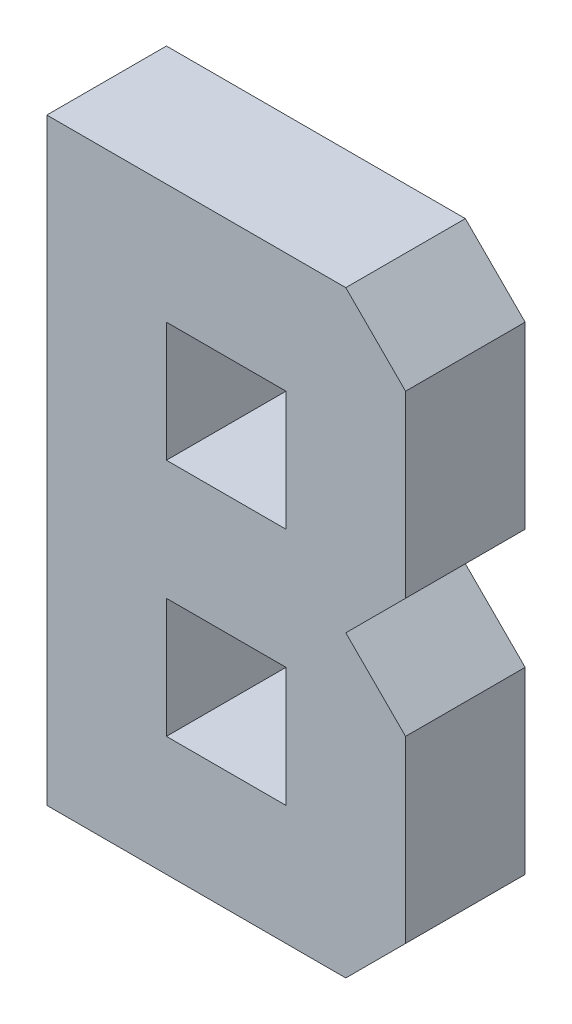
ISO-10303-21;
HEADER;
FILE_DESCRIPTION(('STEP AP214'),'2;1');
FILE_NAME('part.step','',(''),(''),'','','');
FILE_SCHEMA(('AUTOMOTIVE_DESIGN { 1 0 10303 214 1 1 1 1 }'));
ENDSEC;
DATA;
#1=APPLICATION_CONTEXT('core data for automotive mechanical design processes');
#2=APPLICATION_PROTOCOL_DEFINITION('international standard','automotive_design',2000,#1);
#3=PRODUCT_CONTEXT('',#1,'mechanical');
#4=PRODUCT('Part','Part','',(#3));
#5=PRODUCT_RELATED_PRODUCT_CATEGORY('part','',(#4));
#6=PRODUCT_DEFINITION_FORMATION('','',#4);
#7=PRODUCT_DEFINITION_CONTEXT('part definition',#1,'design');
#8=PRODUCT_DEFINITION('design','',#6,#7);
#9=PRODUCT_DEFINITION_SHAPE('','',#8);
#10=(LENGTH_UNIT() NAMED_UNIT(*) SI_UNIT(.MILLI.,.METRE.));
#11=(NAMED_UNIT(*) PLANE_ANGLE_UNIT() SI_UNIT($,.RADIAN.));
#12=(NAMED_UNIT(*) SI_UNIT($,.STERADIAN.) SOLID_ANGLE_UNIT());
#13=UNCERTAINTY_MEASURE_WITH_UNIT(LENGTH_MEASURE(1.E-05),#10,'distance_accuracy_value','');
#14=(GEOMETRIC_REPRESENTATION_CONTEXT(3) GLOBAL_UNCERTAINTY_ASSIGNED_CONTEXT((#13)) GLOBAL_UNIT_ASSIGNED_CONTEXT((#10,
#11,#12)) REPRESENTATION_CONTEXT('',''));
#15=CARTESIAN_POINT('',(0.,0.,0.));
#16=DIRECTION('',(0.,0.,1.));
#17=DIRECTION('',(1.,0.,0.));
#18=AXIS2_PLACEMENT_3D('',#15,#16,#17);
#19=CARTESIAN_POINT('',(0.,0.,10.));
#20=DIRECTION('',(0.,0.,-1.));
#21=DIRECTION('',(-1.,0.,0.));
#22=AXIS2_PLACEMENT_3D('',#19,#20,#21);
#23=PLANE('',#22);
#24=DIRECTION('',(0.,-1.,0.));
#25=VECTOR('',#24,1.);
#26=CARTESIAN_POINT('',(9.99999999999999,40.,10.));
#27=LINE('',#26,#25);
#28=CARTESIAN_POINT('',(9.99999999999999,40.,10.));
#29=VERTEX_POINT('',#28);
#30=CARTESIAN_POINT('',(10.,30.,10.));
#31=VERTEX_POINT('',#30);
#32=EDGE_CURVE('E193',#29,#31,#27,.T.);
#33=ORIENTED_EDGE('',*,*,#32,.F.);
#34=DIRECTION('',(-1.,0.,0.));
#35=VECTOR('',#34,1.);
#36=CARTESIAN_POINT('',(9.99999999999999,40.,10.));
#37=LINE('',#36,#35);
#38=CARTESIAN_POINT('',(20.,40.,10.));
#39=VERTEX_POINT('',#38);
#40=EDGE_CURVE('E201',#39,#29,#37,.T.);
#41=ORIENTED_EDGE('',*,*,#40,.F.);
#42=DIRECTION('',(0.,1.,0.));
#43=VECTOR('',#42,1.);
#44=CARTESIAN_POINT('',(20.,40.,10.));
#45=LINE('',#44,#43);
#46=CARTESIAN_POINT('',(20.,30.,10.));
#47=VERTEX_POINT('',#46);
#48=EDGE_CURVE('E198',#47,#39,#45,.T.);
#49=ORIENTED_EDGE('',*,*,#48,.F.);
#50=DIRECTION('',(1.,0.,0.));
#51=VECTOR('',#50,1.);
#52=CARTESIAN_POINT('',(10.,30.,10.));
#53=LINE('',#52,#51);
#54=EDGE_CURVE('E195',#31,#47,#53,.T.);
#55=ORIENTED_EDGE('',*,*,#54,.F.);
#56=EDGE_LOOP('',(#33,#41,#49,#55));
#57=FACE_BOUND('',#56,.T.);
#58=DIRECTION('',(0.,1.,0.));
#59=VECTOR('',#58,1.);
#60=CARTESIAN_POINT('',(30.,30.,10.));
#61=LINE('',#60,#59);
#62=CARTESIAN_POINT('',(30.,30.,10.));
#63=VERTEX_POINT('',#62);
#64=CARTESIAN_POINT('',(30.,45.,10.));
#65=VERTEX_POINT('',#64);
#66=EDGE_CURVE('E233',#63,#65,#61,.T.);
#67=ORIENTED_EDGE('',*,*,#66,.T.);
#68=DIRECTION('',(0.707106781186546,-0.707106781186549,0.));
#69=VECTOR('',#68,1.);
#70=CARTESIAN_POINT('',(25.,50.,10.));
#71=LINE('',#70,#69);
#72=CARTESIAN_POINT('',(25.,50.,10.));
#73=VERTEX_POINT('',#72);
#74=EDGE_CURVE('E273',#65,#73,#71,.F.);
#75=ORIENTED_EDGE('',*,*,#74,.T.);
#76=DIRECTION('',(-1.,0.,0.));
#77=VECTOR('',#76,1.);
#78=CARTESIAN_POINT('',(0.,50.,10.));
#79=LINE('',#78,#77);
#80=CARTESIAN_POINT('',(0.,50.,10.));
#81=VERTEX_POINT('',#80);
#82=EDGE_CURVE('E236',#73,#81,#79,.T.);
#83=ORIENTED_EDGE('',*,*,#82,.T.);
#84=DIRECTION('',(0.,-1.,0.));
#85=VECTOR('',#84,1.);
#86=CARTESIAN_POINT('',(0.,0.,10.));
#87=LINE('',#86,#85);
#88=CARTESIAN_POINT('',(0.,0.,10.));
#89=VERTEX_POINT('',#88);
#90=EDGE_CURVE('E224',#81,#89,#87,.T.);
#91=ORIENTED_EDGE('',*,*,#90,.T.);
#92=DIRECTION('',(1.,0.,0.));
#93=VECTOR('',#92,1.);
#94=CARTESIAN_POINT('',(0.,0.,10.));
#95=LINE('',#94,#93);
#96=CARTESIAN_POINT('',(25.,0.,10.));
#97=VERTEX_POINT('',#96);
#98=EDGE_CURVE('E227',#89,#97,#95,.T.);
#99=ORIENTED_EDGE('',*,*,#98,.T.);
#100=DIRECTION('',(-0.707106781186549,-0.707106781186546,0.));
#101=VECTOR('',#100,1.);
#102=CARTESIAN_POINT('',(30.,5.,10.));
#103=LINE('',#102,#101);
#104=CARTESIAN_POINT('',(30.,5.,10.));
#105=VERTEX_POINT('',#104);
#106=EDGE_CURVE('E271',#97,#105,#103,.F.);
#107=ORIENTED_EDGE('',*,*,#106,.T.);
#108=DIRECTION('',(0.,1.,0.));
#109=VECTOR('',#108,1.);
#110=CARTESIAN_POINT('',(30.,0.,10.));
#111=LINE('',#110,#109);
#112=CARTESIAN_POINT('',(30.,20.,10.));
#113=VERTEX_POINT('',#112);
#114=EDGE_CURVE('E231',#105,#113,#111,.T.);
#115=ORIENTED_EDGE('',*,*,#114,.T.);
#116=DIRECTION('',(0.707106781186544,-0.707106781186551,0.));
#117=VECTOR('',#116,1.);
#118=CARTESIAN_POINT('',(25.0000000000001,24.9999999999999,10.));
#119=LINE('',#118,#117);
#120=CARTESIAN_POINT('',(25.,25.,10.));
#121=VERTEX_POINT('',#120);
#122=EDGE_CURVE('E11',#113,#121,#119,.F.);
#123=ORIENTED_EDGE('',*,*,#122,.T.);
#124=DIRECTION('',(-0.707106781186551,-0.707106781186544,0.));
#125=VECTOR('',#124,1.);
#126=CARTESIAN_POINT('',(-1.27570012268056E-13,1.27570012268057E-13,10.));
#127=LINE('',#126,#125);
#128=EDGE_CURVE('E281',#121,#63,#127,.F.);
#129=ORIENTED_EDGE('',*,*,#128,.T.);
#130=EDGE_LOOP('',(#67,#75,#83,#91,#99,#107,#115,#123,#129));
#131=FACE_BOUND('',#130,.T.);
#132=DIRECTION('',(0.,-1.,0.));
#133=VECTOR('',#132,1.);
#134=CARTESIAN_POINT('',(10.,20.,10.));
#135=LINE('',#134,#133);
#136=CARTESIAN_POINT('',(10.,20.,10.));
#137=VERTEX_POINT('',#136);
#138=CARTESIAN_POINT('',(10.,10.,10.));
#139=VERTEX_POINT('',#138);
#140=EDGE_CURVE('E152',#137,#139,#135,.T.);
#141=ORIENTED_EDGE('',*,*,#140,.F.);
#142=DIRECTION('',(-1.,0.,0.));
#143=VECTOR('',#142,1.);
#144=CARTESIAN_POINT('',(10.,20.,10.));
#145=LINE('',#144,#143);
#146=CARTESIAN_POINT('',(20.,20.,10.));
#147=VERTEX_POINT('',#146);
#148=EDGE_CURVE('E177',#147,#137,#145,.T.);
#149=ORIENTED_EDGE('',*,*,#148,.F.);
#150=DIRECTION('',(0.,1.,0.));
#151=VECTOR('',#150,1.);
#152=CARTESIAN_POINT('',(20.,20.,10.));
#153=LINE('',#152,#151);
#154=CARTESIAN_POINT('',(20.,10.,10.));
#155=VERTEX_POINT('',#154);
#156=EDGE_CURVE('E175',#155,#147,#153,.T.);
#157=ORIENTED_EDGE('',*,*,#156,.F.);
#158=DIRECTION('',(1.,0.,0.));
#159=VECTOR('',#158,1.);
#160=CARTESIAN_POINT('',(10.,10.,10.));
#161=LINE('',#160,#159);
#162=EDGE_CURVE('E162',#139,#155,#161,.T.);
#163=ORIENTED_EDGE('',*,*,#162,.F.);
#164=EDGE_LOOP('',(#141,#149,#157,#163));
#165=FACE_BOUND('',#164,.T.);
#166=ADVANCED_FACE('F33',(#57,#131,#165),#23,.F.);
#167=CARTESIAN_POINT('',(0.,0.,0.));
#168=DIRECTION('',(0.,0.,-1.));
#169=DIRECTION('',(-1.,0.,0.));
#170=AXIS2_PLACEMENT_3D('',#167,#168,#169);
#171=PLANE('',#170);
#172=DIRECTION('',(-1.,0.,0.));
#173=VECTOR('',#172,1.);
#174=CARTESIAN_POINT('',(0.,50.,0.));
#175=LINE('',#174,#173);
#176=CARTESIAN_POINT('',(25.,50.,0.));
#177=VERTEX_POINT('',#176);
#178=CARTESIAN_POINT('',(0.,50.,0.));
#179=VERTEX_POINT('',#178);
#180=EDGE_CURVE('E228',#177,#179,#175,.T.);
#181=ORIENTED_EDGE('',*,*,#180,.F.);
#182=DIRECTION('',(-0.707106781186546,0.707106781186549,0.));
#183=VECTOR('',#182,1.);
#184=CARTESIAN_POINT('',(37.5,37.4999999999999,0.));
#185=LINE('',#184,#183);
#186=CARTESIAN_POINT('',(30.,45.,0.));
#187=VERTEX_POINT('',#186);
#188=EDGE_CURVE('E267',#177,#187,#185,.F.);
#189=ORIENTED_EDGE('',*,*,#188,.T.);
#190=DIRECTION('',(0.,1.,0.));
#191=VECTOR('',#190,1.);
#192=CARTESIAN_POINT('',(30.,30.,0.));
#193=LINE('',#192,#191);
#194=CARTESIAN_POINT('',(30.,30.,0.));
#195=VERTEX_POINT('',#194);
#196=EDGE_CURVE('E247',#195,#187,#193,.T.);
#197=ORIENTED_EDGE('',*,*,#196,.F.);
#198=DIRECTION('',(0.707106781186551,0.707106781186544,0.));
#199=VECTOR('',#198,1.);
#200=CARTESIAN_POINT('',(30.,30.,0.));
#201=LINE('',#200,#199);
#202=CARTESIAN_POINT('',(25.,25.,0.));
#203=VERTEX_POINT('',#202);
#204=EDGE_CURVE('E55',#195,#203,#201,.F.);
#205=ORIENTED_EDGE('',*,*,#204,.T.);
#206=DIRECTION('',(-0.707106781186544,0.707106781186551,0.));
#207=VECTOR('',#206,1.);
#208=CARTESIAN_POINT('',(25.,25.,0.));
#209=LINE('',#208,#207);
#210=CARTESIAN_POINT('',(30.,20.,0.));
#211=VERTEX_POINT('',#210);
#212=EDGE_CURVE('E42',#203,#211,#209,.F.);
#213=ORIENTED_EDGE('',*,*,#212,.T.);
#214=DIRECTION('',(0.,1.,0.));
#215=VECTOR('',#214,1.);
#216=CARTESIAN_POINT('',(30.,0.,0.));
#217=LINE('',#216,#215);
#218=CARTESIAN_POINT('',(30.,5.,0.));
#219=VERTEX_POINT('',#218);
#220=EDGE_CURVE('E244',#219,#211,#217,.T.);
#221=ORIENTED_EDGE('',*,*,#220,.F.);
#222=DIRECTION('',(0.707106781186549,0.707106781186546,0.));
#223=VECTOR('',#222,1.);
#224=CARTESIAN_POINT('',(12.4999999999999,-12.5,0.));
#225=LINE('',#224,#223);
#226=CARTESIAN_POINT('',(25.,0.,0.));
#227=VERTEX_POINT('',#226);
#228=EDGE_CURVE('E265',#219,#227,#225,.F.);
#229=ORIENTED_EDGE('',*,*,#228,.T.);
#230=DIRECTION('',(1.,0.,0.));
#231=VECTOR('',#230,1.);
#232=CARTESIAN_POINT('',(0.,0.,0.));
#233=LINE('',#232,#231);
#234=CARTESIAN_POINT('',(0.,0.,0.));
#235=VERTEX_POINT('',#234);
#236=EDGE_CURVE('E241',#235,#227,#233,.T.);
#237=ORIENTED_EDGE('',*,*,#236,.F.);
#238=DIRECTION('',(0.,-1.,0.));
#239=VECTOR('',#238,1.);
#240=CARTESIAN_POINT('',(0.,0.,0.));
#241=LINE('',#240,#239);
#242=EDGE_CURVE('E223',#179,#235,#241,.T.);
#243=ORIENTED_EDGE('',*,*,#242,.F.);
#244=EDGE_LOOP('',(#181,#189,#197,#205,#213,#221,#229,#237,#243));
#245=FACE_BOUND('',#244,.T.);
#246=DIRECTION('',(-1.,0.,0.));
#247=VECTOR('',#246,1.);
#248=CARTESIAN_POINT('',(9.99999999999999,40.,0.));
#249=LINE('',#248,#247);
#250=CARTESIAN_POINT('',(20.,40.,0.));
#251=VERTEX_POINT('',#250);
#252=CARTESIAN_POINT('',(9.99999999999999,40.,0.));
#253=VERTEX_POINT('',#252);
#254=EDGE_CURVE('E196',#251,#253,#249,.T.);
#255=ORIENTED_EDGE('',*,*,#254,.T.);
#256=DIRECTION('',(0.,-1.,0.));
#257=VECTOR('',#256,1.);
#258=CARTESIAN_POINT('',(9.99999999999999,40.,0.));
#259=LINE('',#258,#257);
#260=CARTESIAN_POINT('',(10.,30.,0.));
#261=VERTEX_POINT('',#260);
#262=EDGE_CURVE('E170',#253,#261,#259,.T.);
#263=ORIENTED_EDGE('',*,*,#262,.T.);
#264=DIRECTION('',(1.,0.,0.));
#265=VECTOR('',#264,1.);
#266=CARTESIAN_POINT('',(10.,30.,0.));
#267=LINE('',#266,#265);
#268=CARTESIAN_POINT('',(20.,30.,0.));
#269=VERTEX_POINT('',#268);
#270=EDGE_CURVE('E206',#261,#269,#267,.T.);
#271=ORIENTED_EDGE('',*,*,#270,.T.);
#272=DIRECTION('',(0.,1.,0.));
#273=VECTOR('',#272,1.);
#274=CARTESIAN_POINT('',(20.,40.,0.));
#275=LINE('',#274,#273);
#276=EDGE_CURVE('E209',#269,#251,#275,.T.);
#277=ORIENTED_EDGE('',*,*,#276,.T.);
#278=EDGE_LOOP('',(#255,#263,#271,#277));
#279=FACE_BOUND('',#278,.T.);
#280=DIRECTION('',(-1.,0.,0.));
#281=VECTOR('',#280,1.);
#282=CARTESIAN_POINT('',(10.,20.,0.));
#283=LINE('',#282,#281);
#284=CARTESIAN_POINT('',(20.,20.,0.));
#285=VERTEX_POINT('',#284);
#286=CARTESIAN_POINT('',(10.,20.,0.));
#287=VERTEX_POINT('',#286);
#288=EDGE_CURVE('E163',#285,#287,#283,.T.);
#289=ORIENTED_EDGE('',*,*,#288,.T.);
#290=DIRECTION('',(0.,-1.,0.));
#291=VECTOR('',#290,1.);
#292=CARTESIAN_POINT('',(10.,20.,0.));
#293=LINE('',#292,#291);
#294=CARTESIAN_POINT('',(10.,10.,0.));
#295=VERTEX_POINT('',#294);
#296=EDGE_CURVE('E181',#287,#295,#293,.T.);
#297=ORIENTED_EDGE('',*,*,#296,.T.);
#298=DIRECTION('',(1.,0.,0.));
#299=VECTOR('',#298,1.);
#300=CARTESIAN_POINT('',(10.,10.,0.));
#301=LINE('',#300,#299);
#302=CARTESIAN_POINT('',(20.,10.,0.));
#303=VERTEX_POINT('',#302);
#304=EDGE_CURVE('E169',#295,#303,#301,.T.);
#305=ORIENTED_EDGE('',*,*,#304,.T.);
#306=DIRECTION('',(0.,1.,0.));
#307=VECTOR('',#306,1.);
#308=CARTESIAN_POINT('',(20.,20.,0.));
#309=LINE('',#308,#307);
#310=EDGE_CURVE('E184',#303,#285,#309,.T.);
#311=ORIENTED_EDGE('',*,*,#310,.T.);
#312=EDGE_LOOP('',(#289,#297,#305,#311));
#313=FACE_BOUND('',#312,.T.);
#314=ADVANCED_FACE('F285',(#245,#279,#313),#171,.T.);
#315=CARTESIAN_POINT('',(0.,0.,10.));
#316=DIRECTION('',(1.,0.,0.));
#317=DIRECTION('',(0.,0.,-1.));
#318=AXIS2_PLACEMENT_3D('',#315,#316,#317);
#319=PLANE('',#318);
#320=ORIENTED_EDGE('',*,*,#242,.T.);
#321=DIRECTION('',(0.,0.,-1.));
#322=VECTOR('',#321,1.);
#323=CARTESIAN_POINT('',(0.,0.,10.));
#324=LINE('',#323,#322);
#325=EDGE_CURVE('E259',#89,#235,#324,.T.);
#326=ORIENTED_EDGE('',*,*,#325,.F.);
#327=ORIENTED_EDGE('',*,*,#90,.F.);
#328=DIRECTION('',(0.,0.,-1.));
#329=VECTOR('',#328,1.);
#330=CARTESIAN_POINT('',(0.,50.,10.));
#331=LINE('',#330,#329);
#332=EDGE_CURVE('E238',#81,#179,#331,.T.);
#333=ORIENTED_EDGE('',*,*,#332,.T.);
#334=EDGE_LOOP('',(#320,#326,#327,#333));
#335=FACE_BOUND('',#334,.T.);
#336=ADVANCED_FACE('F314',(#335),#319,.F.);
#337=CARTESIAN_POINT('',(0.,0.,10.));
#338=DIRECTION('',(0.,1.,0.));
#339=DIRECTION('',(0.,0.,1.));
#340=AXIS2_PLACEMENT_3D('',#337,#338,#339);
#341=PLANE('',#340);
#342=ORIENTED_EDGE('',*,*,#236,.T.);
#343=DIRECTION('',(0.,0.,1.));
#344=VECTOR('',#343,1.);
#345=CARTESIAN_POINT('',(25.,0.,10.));
#346=LINE('',#345,#344);
#347=EDGE_CURVE('E278',#227,#97,#346,.T.);
#348=ORIENTED_EDGE('',*,*,#347,.T.);
#349=ORIENTED_EDGE('',*,*,#98,.F.);
#350=ORIENTED_EDGE('',*,*,#325,.T.);
#351=EDGE_LOOP('',(#342,#348,#349,#350));
#352=FACE_BOUND('',#351,.T.);
#353=ADVANCED_FACE('F320',(#352),#341,.F.);
#354=CARTESIAN_POINT('',(30.,0.,10.));
#355=DIRECTION('',(-1.,0.,0.));
#356=DIRECTION('',(0.,0.,1.));
#357=AXIS2_PLACEMENT_3D('',#354,#355,#356);
#358=PLANE('',#357);
#359=ORIENTED_EDGE('',*,*,#114,.F.);
#360=DIRECTION('',(0.,0.,-1.));
#361=VECTOR('',#360,1.);
#362=CARTESIAN_POINT('',(30.,5.,10.));
#363=LINE('',#362,#361);
#364=EDGE_CURVE('E275',#105,#219,#363,.T.);
#365=ORIENTED_EDGE('',*,*,#364,.T.);
#366=ORIENTED_EDGE('',*,*,#220,.T.);
#367=DIRECTION('',(0.,0.,-1.));
#368=VECTOR('',#367,1.);
#369=CARTESIAN_POINT('',(30.,20.,10.));
#370=LINE('',#369,#368);
#371=EDGE_CURVE('E256',#113,#211,#370,.T.);
#372=ORIENTED_EDGE('',*,*,#371,.F.);
#373=EDGE_LOOP('',(#359,#365,#366,#372));
#374=FACE_BOUND('',#373,.T.);
#375=ADVANCED_FACE('F292',(#374),#358,.F.);
#376=CARTESIAN_POINT('',(30.,30.,10.));
#377=DIRECTION('',(-1.,0.,0.));
#378=DIRECTION('',(0.,0.,1.));
#379=AXIS2_PLACEMENT_3D('',#376,#377,#378);
#380=PLANE('',#379);
#381=ORIENTED_EDGE('',*,*,#196,.T.);
#382=DIRECTION('',(0.,0.,1.));
#383=VECTOR('',#382,1.);
#384=CARTESIAN_POINT('',(30.,45.,10.));
#385=LINE('',#384,#383);
#386=EDGE_CURVE('E269',#187,#65,#385,.T.);
#387=ORIENTED_EDGE('',*,*,#386,.T.);
#388=ORIENTED_EDGE('',*,*,#66,.F.);
#389=DIRECTION('',(0.,0.,-1.));
#390=VECTOR('',#389,1.);
#391=CARTESIAN_POINT('',(30.,30.,10.));
#392=LINE('',#391,#390);
#393=EDGE_CURVE('E253',#63,#195,#392,.T.);
#394=ORIENTED_EDGE('',*,*,#393,.T.);
#395=EDGE_LOOP('',(#381,#387,#388,#394));
#396=FACE_BOUND('',#395,.T.);
#397=ADVANCED_FACE('F301',(#396),#380,.F.);
#398=CARTESIAN_POINT('',(0.,50.,10.));
#399=DIRECTION('',(0.,-1.,0.));
#400=DIRECTION('',(0.,0.,-1.));
#401=AXIS2_PLACEMENT_3D('',#398,#399,#400);
#402=PLANE('',#401);
#403=ORIENTED_EDGE('',*,*,#82,.F.);
#404=DIRECTION('',(0.,0.,-1.));
#405=VECTOR('',#404,1.);
#406=CARTESIAN_POINT('',(25.,50.,10.));
#407=LINE('',#406,#405);
#408=EDGE_CURVE('E262',#73,#177,#407,.T.);
#409=ORIENTED_EDGE('',*,*,#408,.T.);
#410=ORIENTED_EDGE('',*,*,#180,.T.);
#411=ORIENTED_EDGE('',*,*,#332,.F.);
#412=EDGE_LOOP('',(#403,#409,#410,#411));
#413=FACE_BOUND('',#412,.T.);
#414=ADVANCED_FACE('F309',(#413),#402,.F.);
#415=CARTESIAN_POINT('',(9.99999999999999,40.,10.));
#416=DIRECTION('',(1.,0.,0.));
#417=DIRECTION('',(0.,1.,0.));
#418=AXIS2_PLACEMENT_3D('',#415,#416,#417);
#419=PLANE('',#418);
#420=ORIENTED_EDGE('',*,*,#262,.F.);
#421=DIRECTION('',(0.,0.,-1.));
#422=VECTOR('',#421,1.);
#423=CARTESIAN_POINT('',(9.99999999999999,40.,10.));
#424=LINE('',#423,#422);
#425=EDGE_CURVE('E203',#29,#253,#424,.T.);
#426=ORIENTED_EDGE('',*,*,#425,.F.);
#427=ORIENTED_EDGE('',*,*,#32,.T.);
#428=DIRECTION('',(0.,0.,-1.));
#429=VECTOR('',#428,1.);
#430=CARTESIAN_POINT('',(10.,30.,10.));
#431=LINE('',#430,#429);
#432=EDGE_CURVE('E220',#31,#261,#431,.T.);
#433=ORIENTED_EDGE('',*,*,#432,.T.);
#434=EDGE_LOOP('',(#420,#426,#427,#433));
#435=FACE_BOUND('',#434,.T.);
#436=ADVANCED_FACE('F338',(#435),#419,.T.);
#437=CARTESIAN_POINT('',(10.,30.,10.));
#438=DIRECTION('',(0.,1.,0.));
#439=DIRECTION('',(0.,0.,1.));
#440=AXIS2_PLACEMENT_3D('',#437,#438,#439);
#441=PLANE('',#440);
#442=ORIENTED_EDGE('',*,*,#270,.F.);
#443=ORIENTED_EDGE('',*,*,#432,.F.);
#444=ORIENTED_EDGE('',*,*,#54,.T.);
#445=DIRECTION('',(0.,0.,-1.));
#446=VECTOR('',#445,1.);
#447=CARTESIAN_POINT('',(20.,30.,10.));
#448=LINE('',#447,#446);
#449=EDGE_CURVE('E218',#47,#269,#448,.T.);
#450=ORIENTED_EDGE('',*,*,#449,.T.);
#451=EDGE_LOOP('',(#442,#443,#444,#450));
#452=FACE_BOUND('',#451,.T.);
#453=ADVANCED_FACE('F359',(#452),#441,.T.);
#454=CARTESIAN_POINT('',(20.,40.,10.));
#455=DIRECTION('',(-1.,0.,0.));
#456=DIRECTION('',(0.,-1.,0.));
#457=AXIS2_PLACEMENT_3D('',#454,#455,#456);
#458=PLANE('',#457);
#459=ORIENTED_EDGE('',*,*,#276,.F.);
#460=ORIENTED_EDGE('',*,*,#449,.F.);
#461=ORIENTED_EDGE('',*,*,#48,.T.);
#462=DIRECTION('',(0.,0.,-1.));
#463=VECTOR('',#462,1.);
#464=CARTESIAN_POINT('',(20.,40.,10.));
#465=LINE('',#464,#463);
#466=EDGE_CURVE('E216',#39,#251,#465,.T.);
#467=ORIENTED_EDGE('',*,*,#466,.T.);
#468=EDGE_LOOP('',(#459,#460,#461,#467));
#469=FACE_BOUND('',#468,.T.);
#470=ADVANCED_FACE('F367',(#469),#458,.T.);
#471=CARTESIAN_POINT('',(9.99999999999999,40.,10.));
#472=DIRECTION('',(0.,-1.,0.));
#473=DIRECTION('',(0.,0.,-1.));
#474=AXIS2_PLACEMENT_3D('',#471,#472,#473);
#475=PLANE('',#474);
#476=ORIENTED_EDGE('',*,*,#254,.F.);
#477=ORIENTED_EDGE('',*,*,#466,.F.);
#478=ORIENTED_EDGE('',*,*,#40,.T.);
#479=ORIENTED_EDGE('',*,*,#425,.T.);
#480=EDGE_LOOP('',(#476,#477,#478,#479));
#481=FACE_BOUND('',#480,.T.);
#482=ADVANCED_FACE('F374',(#481),#475,.T.);
#483=CARTESIAN_POINT('',(10.,20.,10.));
#484=DIRECTION('',(1.,0.,0.));
#485=DIRECTION('',(0.,0.,-1.));
#486=AXIS2_PLACEMENT_3D('',#483,#484,#485);
#487=PLANE('',#486);
#488=ORIENTED_EDGE('',*,*,#296,.F.);
#489=DIRECTION('',(0.,0.,-1.));
#490=VECTOR('',#489,1.);
#491=CARTESIAN_POINT('',(10.,20.,10.));
#492=LINE('',#491,#490);
#493=EDGE_CURVE('E158',#137,#287,#492,.T.);
#494=ORIENTED_EDGE('',*,*,#493,.F.);
#495=ORIENTED_EDGE('',*,*,#140,.T.);
#496=DIRECTION('',(0.,0.,-1.));
#497=VECTOR('',#496,1.);
#498=CARTESIAN_POINT('',(10.,10.,10.));
#499=LINE('',#498,#497);
#500=EDGE_CURVE('E155',#139,#295,#499,.T.);
#501=ORIENTED_EDGE('',*,*,#500,.T.);
#502=EDGE_LOOP('',(#488,#494,#495,#501));
#503=FACE_BOUND('',#502,.T.);
#504=ADVANCED_FACE('F154',(#503),#487,.T.);
#505=CARTESIAN_POINT('',(10.,10.,10.));
#506=DIRECTION('',(0.,1.,0.));
#507=DIRECTION('',(0.,0.,1.));
#508=AXIS2_PLACEMENT_3D('',#505,#506,#507);
#509=PLANE('',#508);
#510=ORIENTED_EDGE('',*,*,#304,.F.);
#511=ORIENTED_EDGE('',*,*,#500,.F.);
#512=ORIENTED_EDGE('',*,*,#162,.T.);
#513=DIRECTION('',(0.,0.,-1.));
#514=VECTOR('',#513,1.);
#515=CARTESIAN_POINT('',(20.,10.,10.));
#516=LINE('',#515,#514);
#517=EDGE_CURVE('E171',#155,#303,#516,.T.);
#518=ORIENTED_EDGE('',*,*,#517,.T.);
#519=EDGE_LOOP('',(#510,#511,#512,#518));
#520=FACE_BOUND('',#519,.T.);
#521=ADVANCED_FACE('F166',(#520),#509,.T.);
#522=CARTESIAN_POINT('',(20.,20.,10.));
#523=DIRECTION('',(-1.,0.,0.));
#524=DIRECTION('',(0.,-1.,0.));
#525=AXIS2_PLACEMENT_3D('',#522,#523,#524);
#526=PLANE('',#525);
#527=ORIENTED_EDGE('',*,*,#310,.F.);
#528=ORIENTED_EDGE('',*,*,#517,.F.);
#529=ORIENTED_EDGE('',*,*,#156,.T.);
#530=DIRECTION('',(0.,0.,-1.));
#531=VECTOR('',#530,1.);
#532=CARTESIAN_POINT('',(20.,20.,10.));
#533=LINE('',#532,#531);
#534=EDGE_CURVE('E190',#147,#285,#533,.T.);
#535=ORIENTED_EDGE('',*,*,#534,.T.);
#536=EDGE_LOOP('',(#527,#528,#529,#535));
#537=FACE_BOUND('',#536,.T.);
#538=ADVANCED_FACE('F395',(#537),#526,.T.);
#539=CARTESIAN_POINT('',(10.,20.,10.));
#540=DIRECTION('',(0.,-1.,0.));
#541=DIRECTION('',(0.,0.,-1.));
#542=AXIS2_PLACEMENT_3D('',#539,#540,#541);
#543=PLANE('',#542);
#544=ORIENTED_EDGE('',*,*,#288,.F.);
#545=ORIENTED_EDGE('',*,*,#534,.F.);
#546=ORIENTED_EDGE('',*,*,#148,.T.);
#547=ORIENTED_EDGE('',*,*,#493,.T.);
#548=EDGE_LOOP('',(#544,#545,#546,#547));
#549=FACE_BOUND('',#548,.T.);
#550=ADVANCED_FACE('F402',(#549),#543,.T.);
#551=CARTESIAN_POINT('',(25.,50.,10.));
#552=DIRECTION('',(-0.707106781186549,-0.707106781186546,0.));
#553=DIRECTION('',(0.,0.,-1.));
#554=AXIS2_PLACEMENT_3D('',#551,#552,#553);
#555=PLANE('',#554);
#556=ORIENTED_EDGE('',*,*,#74,.F.);
#557=ORIENTED_EDGE('',*,*,#386,.F.);
#558=ORIENTED_EDGE('',*,*,#188,.F.);
#559=ORIENTED_EDGE('',*,*,#408,.F.);
#560=EDGE_LOOP('',(#556,#557,#558,#559));
#561=FACE_BOUND('',#560,.T.);
#562=ADVANCED_FACE('F304',(#561),#555,.F.);
#563=CARTESIAN_POINT('',(30.,5.,10.));
#564=DIRECTION('',(-0.707106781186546,0.707106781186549,0.));
#565=DIRECTION('',(0.,0.,-1.));
#566=AXIS2_PLACEMENT_3D('',#563,#564,#565);
#567=PLANE('',#566);
#568=ORIENTED_EDGE('',*,*,#106,.F.);
#569=ORIENTED_EDGE('',*,*,#347,.F.);
#570=ORIENTED_EDGE('',*,*,#228,.F.);
#571=ORIENTED_EDGE('',*,*,#364,.F.);
#572=EDGE_LOOP('',(#568,#569,#570,#571));
#573=FACE_BOUND('',#572,.T.);
#574=ADVANCED_FACE('F319',(#573),#567,.F.);
#575=CARTESIAN_POINT('',(25.,25.,10.));
#576=DIRECTION('',(0.707106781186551,0.707106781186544,0.));
#577=DIRECTION('',(0.,0.,1.));
#578=AXIS2_PLACEMENT_3D('',#575,#576,#577);
#579=PLANE('',#578);
#580=DIRECTION('',(0.,0.,-1.));
#581=VECTOR('',#580,1.);
#582=CARTESIAN_POINT('',(25.,25.,0.));
#583=LINE('',#582,#581);
#584=EDGE_CURVE('E37',#121,#203,#583,.T.);
#585=ORIENTED_EDGE('',*,*,#584,.F.);
#586=ORIENTED_EDGE('',*,*,#122,.F.);
#587=ORIENTED_EDGE('',*,*,#371,.T.);
#588=ORIENTED_EDGE('',*,*,#212,.F.);
#589=EDGE_LOOP('',(#585,#586,#587,#588));
#590=FACE_BOUND('',#589,.T.);
#591=ADVANCED_FACE('F35',(#590),#579,.T.);
#592=CARTESIAN_POINT('',(30.,30.,10.));
#593=DIRECTION('',(0.707106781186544,-0.707106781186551,0.));
#594=DIRECTION('',(0.,0.,1.));
#595=AXIS2_PLACEMENT_3D('',#592,#593,#594);
#596=PLANE('',#595);
#597=ORIENTED_EDGE('',*,*,#128,.F.);
#598=ORIENTED_EDGE('',*,*,#584,.T.);
#599=ORIENTED_EDGE('',*,*,#204,.F.);
#600=ORIENTED_EDGE('',*,*,#393,.F.);
#601=EDGE_LOOP('',(#597,#598,#599,#600));
#602=FACE_BOUND('',#601,.T.);
#603=ADVANCED_FACE('F297',(#602),#596,.T.);
#604=CLOSED_SHELL('',(#166,#314,#336,#353,#375,#397,#414,#436,#453,#470,#482,#504,#521,#538,
#550,#562,#574,#591,#603));
#605=MANIFOLD_SOLID_BREP('B2',#604);
#606=ADVANCED_BREP_SHAPE_REPRESENTATION('',(#18,#605),#14);
#607=SHAPE_DEFINITION_REPRESENTATION(#9,#606);
ENDSEC;
END-ISO-10303-21;
